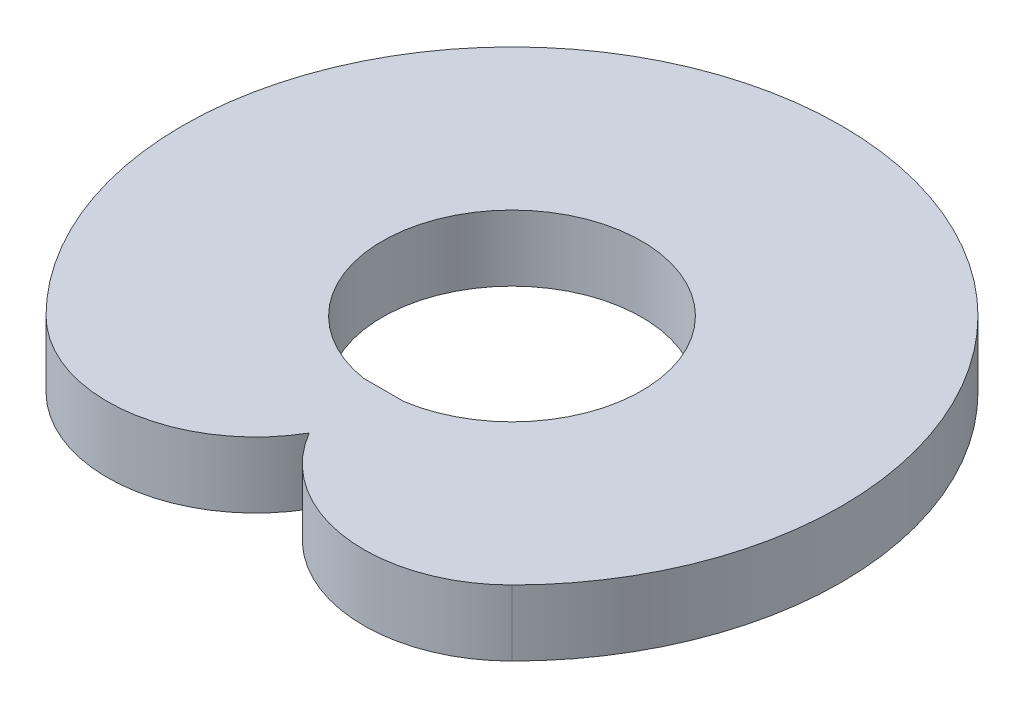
ISO-10303-21;
HEADER;
FILE_DESCRIPTION(('STEP AP214'),'2;1');
FILE_NAME('part.step','',(''),(''),'','','');
FILE_SCHEMA(('AUTOMOTIVE_DESIGN { 1 0 10303 214 1 1 1 1 }'));
ENDSEC;
DATA;
#1=APPLICATION_CONTEXT('core data for automotive mechanical design processes');
#2=APPLICATION_PROTOCOL_DEFINITION('international standard','automotive_design',2000,#1);
#3=PRODUCT_CONTEXT('',#1,'mechanical');
#4=PRODUCT('Part','Part','',(#3));
#5=PRODUCT_RELATED_PRODUCT_CATEGORY('part','',(#4));
#6=PRODUCT_DEFINITION_FORMATION('','',#4);
#7=PRODUCT_DEFINITION_CONTEXT('part definition',#1,'design');
#8=PRODUCT_DEFINITION('design','',#6,#7);
#9=PRODUCT_DEFINITION_SHAPE('','',#8);
#10=(LENGTH_UNIT() NAMED_UNIT(*) SI_UNIT(.MILLI.,.METRE.));
#11=(NAMED_UNIT(*) PLANE_ANGLE_UNIT() SI_UNIT($,.RADIAN.));
#12=(NAMED_UNIT(*) SI_UNIT($,.STERADIAN.) SOLID_ANGLE_UNIT());
#13=UNCERTAINTY_MEASURE_WITH_UNIT(LENGTH_MEASURE(1.E-05),#10,'distance_accuracy_value','');
#14=(GEOMETRIC_REPRESENTATION_CONTEXT(3) GLOBAL_UNCERTAINTY_ASSIGNED_CONTEXT((#13)) GLOBAL_UNIT_ASSIGNED_CONTEXT((#10,
#11,#12)) REPRESENTATION_CONTEXT('',''));
#15=CARTESIAN_POINT('',(0.,0.,0.));
#16=DIRECTION('',(0.,0.,1.));
#17=DIRECTION('',(1.,0.,0.));
#18=AXIS2_PLACEMENT_3D('',#15,#16,#17);
#19=CARTESIAN_POINT('',(194.4543648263,200.,194.454364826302));
#20=DIRECTION('',(0.,1.,0.));
#21=DIRECTION('',(0.,0.,1.));
#22=AXIS2_PLACEMENT_3D('',#19,#20,#21);
#23=PLANE('',#22);
#24=CARTESIAN_POINT('',(388.908729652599,200.,388.908729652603));
#25=DIRECTION('',(0.,1.,0.));
#26=DIRECTION('',(0.,0.,1.));
#27=AXIS2_PLACEMENT_3D('',#24,#25,#26);
#28=CIRCLE('',#27,450.);
#29=CARTESIAN_POINT('',(2.22044604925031E-13,200.,615.293358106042));
#30=VERTEX_POINT('',#29);
#31=CARTESIAN_POINT('',(707.106781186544,200.,707.106781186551));
#32=VERTEX_POINT('',#31);
#33=EDGE_CURVE('E98',#30,#32,#28,.T.);
#34=ORIENTED_EDGE('',*,*,#33,.T.);
#35=CARTESIAN_POINT('',(0.,200.,0.));
#36=DIRECTION('',(0.,1.,0.));
#37=DIRECTION('',(0.,0.,1.));
#38=AXIS2_PLACEMENT_3D('',#35,#36,#37);
#39=CIRCLE('',#38,1000.);
#40=CARTESIAN_POINT('',(-707.106781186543,200.,707.106781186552));
#41=VERTEX_POINT('',#40);
#42=EDGE_CURVE('E101',#32,#41,#39,.T.);
#43=ORIENTED_EDGE('',*,*,#42,.T.);
#44=CARTESIAN_POINT('',(-388.908729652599,200.,388.908729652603));
#45=DIRECTION('',(0.,1.,0.));
#46=DIRECTION('',(0.,0.,1.));
#47=AXIS2_PLACEMENT_3D('',#44,#45,#46);
#48=CIRCLE('',#47,450.);
#49=EDGE_CURVE('E104',#41,#30,#48,.T.);
#50=ORIENTED_EDGE('',*,*,#49,.T.);
#51=EDGE_LOOP('',(#34,#43,#50));
#52=FACE_BOUND('',#51,.T.);
#53=DIRECTION('',(1.,0.,0.));
#54=VECTOR('',#53,1.);
#55=CARTESIAN_POINT('',(61.0912703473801,200.,388.908729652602));
#56=LINE('',#55,#54);
#57=CARTESIAN_POINT('',(-61.0912703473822,200.,388.908729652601));
#58=VERTEX_POINT('',#57);
#59=CARTESIAN_POINT('',(61.0912703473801,200.,388.908729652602));
#60=VERTEX_POINT('',#59);
#61=EDGE_CURVE('E81',#58,#60,#56,.T.);
#62=ORIENTED_EDGE('',*,*,#61,.F.);
#63=CARTESIAN_POINT('',(0.,200.,0.));
#64=DIRECTION('',(0.,1.,0.));
#65=DIRECTION('',(0.,0.,1.));
#66=AXIS2_PLACEMENT_3D('',#63,#64,#65);
#67=CIRCLE('',#66,393.677715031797);
#68=EDGE_CURVE('E87',#60,#58,#67,.T.);
#69=ORIENTED_EDGE('',*,*,#68,.F.);
#70=EDGE_LOOP('',(#62,#69));
#71=FACE_BOUND('',#70,.T.);
#72=ADVANCED_FACE('F35',(#52,#71),#23,.T.);
#73=CARTESIAN_POINT('',(194.4543648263,0.,194.454364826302));
#74=DIRECTION('',(0.,1.,0.));
#75=DIRECTION('',(0.,0.,1.));
#76=AXIS2_PLACEMENT_3D('',#73,#74,#75);
#77=PLANE('',#76);
#78=CARTESIAN_POINT('',(388.908729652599,0.,388.908729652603));
#79=DIRECTION('',(0.,1.,0.));
#80=DIRECTION('',(0.,0.,1.));
#81=AXIS2_PLACEMENT_3D('',#78,#79,#80);
#82=CIRCLE('',#81,450.);
#83=CARTESIAN_POINT('',(2.22044604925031E-13,0.,615.293358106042));
#84=VERTEX_POINT('',#83);
#85=CARTESIAN_POINT('',(707.106781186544,0.,707.106781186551));
#86=VERTEX_POINT('',#85);
#87=EDGE_CURVE('E97',#84,#86,#82,.T.);
#88=ORIENTED_EDGE('',*,*,#87,.F.);
#89=CARTESIAN_POINT('',(-388.908729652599,0.,388.908729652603));
#90=DIRECTION('',(0.,1.,0.));
#91=DIRECTION('',(0.,0.,1.));
#92=AXIS2_PLACEMENT_3D('',#89,#90,#91);
#93=CIRCLE('',#92,450.);
#94=CARTESIAN_POINT('',(-707.106781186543,0.,707.106781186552));
#95=VERTEX_POINT('',#94);
#96=EDGE_CURVE('E102',#95,#84,#93,.T.);
#97=ORIENTED_EDGE('',*,*,#96,.F.);
#98=CARTESIAN_POINT('',(0.,0.,0.));
#99=DIRECTION('',(0.,1.,0.));
#100=DIRECTION('',(0.,0.,1.));
#101=AXIS2_PLACEMENT_3D('',#98,#99,#100);
#102=CIRCLE('',#101,1000.);
#103=EDGE_CURVE('E109',#86,#95,#102,.T.);
#104=ORIENTED_EDGE('',*,*,#103,.F.);
#105=EDGE_LOOP('',(#88,#97,#104));
#106=FACE_BOUND('',#105,.T.);
#107=CARTESIAN_POINT('',(0.,0.,0.));
#108=DIRECTION('',(0.,1.,0.));
#109=DIRECTION('',(0.,0.,1.));
#110=AXIS2_PLACEMENT_3D('',#107,#108,#109);
#111=CIRCLE('',#110,393.677715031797);
#112=CARTESIAN_POINT('',(61.0912703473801,0.,388.908729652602));
#113=VERTEX_POINT('',#112);
#114=CARTESIAN_POINT('',(-61.0912703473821,0.,388.908729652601));
#115=VERTEX_POINT('',#114);
#116=EDGE_CURVE('E57',#113,#115,#111,.T.);
#117=ORIENTED_EDGE('',*,*,#116,.T.);
#118=DIRECTION('',(1.,0.,0.));
#119=VECTOR('',#118,1.);
#120=CARTESIAN_POINT('',(61.0912703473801,0.,388.908729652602));
#121=LINE('',#120,#119);
#122=EDGE_CURVE('E91',#115,#113,#121,.T.);
#123=ORIENTED_EDGE('',*,*,#122,.T.);
#124=EDGE_LOOP('',(#117,#123));
#125=FACE_BOUND('',#124,.T.);
#126=ADVANCED_FACE('F123',(#106,#125),#77,.F.);
#127=CARTESIAN_POINT('',(388.908729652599,200.,388.908729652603));
#128=DIRECTION('',(0.,-1.,0.));
#129=DIRECTION('',(0.,0.,-1.));
#130=AXIS2_PLACEMENT_3D('',#127,#128,#129);
#131=CYLINDRICAL_SURFACE('',#130,450.);
#132=ORIENTED_EDGE('',*,*,#87,.T.);
#133=DIRECTION('',(0.,-1.,0.));
#134=VECTOR('',#133,1.);
#135=CARTESIAN_POINT('',(707.106781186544,200.,707.106781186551));
#136=LINE('',#135,#134);
#137=EDGE_CURVE('E11',#32,#86,#136,.T.);
#138=ORIENTED_EDGE('',*,*,#137,.F.);
#139=ORIENTED_EDGE('',*,*,#33,.F.);
#140=DIRECTION('',(0.,-1.,0.));
#141=VECTOR('',#140,1.);
#142=CARTESIAN_POINT('',(2.22044604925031E-13,200.,615.293358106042));
#143=LINE('',#142,#141);
#144=EDGE_CURVE('E106',#30,#84,#143,.T.);
#145=ORIENTED_EDGE('',*,*,#144,.T.);
#146=EDGE_LOOP('',(#132,#138,#139,#145));
#147=FACE_BOUND('',#146,.T.);
#148=ADVANCED_FACE('F37',(#147),#131,.T.);
#149=CARTESIAN_POINT('',(0.,200.,0.));
#150=DIRECTION('',(0.,-1.,0.));
#151=DIRECTION('',(0.,0.,-1.));
#152=AXIS2_PLACEMENT_3D('',#149,#150,#151);
#153=CYLINDRICAL_SURFACE('',#152,1000.);
#154=ORIENTED_EDGE('',*,*,#103,.T.);
#155=DIRECTION('',(0.,-1.,0.));
#156=VECTOR('',#155,1.);
#157=CARTESIAN_POINT('',(-707.106781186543,200.,707.106781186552));
#158=LINE('',#157,#156);
#159=EDGE_CURVE('E43',#41,#95,#158,.T.);
#160=ORIENTED_EDGE('',*,*,#159,.F.);
#161=ORIENTED_EDGE('',*,*,#42,.F.);
#162=ORIENTED_EDGE('',*,*,#137,.T.);
#163=EDGE_LOOP('',(#154,#160,#161,#162));
#164=FACE_BOUND('',#163,.T.);
#165=ADVANCED_FACE('F129',(#164),#153,.T.);
#166=CARTESIAN_POINT('',(-388.908729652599,200.,388.908729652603));
#167=DIRECTION('',(0.,-1.,0.));
#168=DIRECTION('',(0.,0.,-1.));
#169=AXIS2_PLACEMENT_3D('',#166,#167,#168);
#170=CYLINDRICAL_SURFACE('',#169,450.);
#171=ORIENTED_EDGE('',*,*,#96,.T.);
#172=ORIENTED_EDGE('',*,*,#144,.F.);
#173=ORIENTED_EDGE('',*,*,#49,.F.);
#174=ORIENTED_EDGE('',*,*,#159,.T.);
#175=EDGE_LOOP('',(#171,#172,#173,#174));
#176=FACE_BOUND('',#175,.T.);
#177=ADVANCED_FACE('F118',(#176),#170,.T.);
#178=CARTESIAN_POINT('',(0.,200.,0.));
#179=DIRECTION('',(0.,-1.,0.));
#180=DIRECTION('',(0.,0.,-1.));
#181=AXIS2_PLACEMENT_3D('',#178,#179,#180);
#182=CYLINDRICAL_SURFACE('',#181,393.677715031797);
#183=ORIENTED_EDGE('',*,*,#116,.F.);
#184=DIRECTION('',(0.,-1.,0.));
#185=VECTOR('',#184,1.);
#186=CARTESIAN_POINT('',(61.0912703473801,200.,388.908729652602));
#187=LINE('',#186,#185);
#188=EDGE_CURVE('E83',#60,#113,#187,.T.);
#189=ORIENTED_EDGE('',*,*,#188,.F.);
#190=ORIENTED_EDGE('',*,*,#68,.T.);
#191=DIRECTION('',(0.,-1.,0.));
#192=VECTOR('',#191,1.);
#193=CARTESIAN_POINT('',(-61.0912703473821,200.,388.908729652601));
#194=LINE('',#193,#192);
#195=EDGE_CURVE('E50',#58,#115,#194,.T.);
#196=ORIENTED_EDGE('',*,*,#195,.T.);
#197=EDGE_LOOP('',(#183,#189,#190,#196));
#198=FACE_BOUND('',#197,.T.);
#199=ADVANCED_FACE('F89',(#198),#182,.F.);
#200=CARTESIAN_POINT('',(61.0912703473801,200.,388.908729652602));
#201=DIRECTION('',(0.,0.,-1.));
#202=DIRECTION('',(-1.,0.,0.));
#203=AXIS2_PLACEMENT_3D('',#200,#201,#202);
#204=PLANE('',#203);
#205=ORIENTED_EDGE('',*,*,#122,.F.);
#206=ORIENTED_EDGE('',*,*,#195,.F.);
#207=ORIENTED_EDGE('',*,*,#61,.T.);
#208=ORIENTED_EDGE('',*,*,#188,.T.);
#209=EDGE_LOOP('',(#205,#206,#207,#208));
#210=FACE_BOUND('',#209,.T.);
#211=ADVANCED_FACE('F82',(#210),#204,.T.);
#212=CLOSED_SHELL('',(#72,#126,#148,#165,#177,#199,#211));
#213=MANIFOLD_SOLID_BREP('B2',#212);
#214=ADVANCED_BREP_SHAPE_REPRESENTATION('',(#18,#213),#14);
#215=SHAPE_DEFINITION_REPRESENTATION(#9,#214);
ENDSEC;
END-ISO-10303-21;
